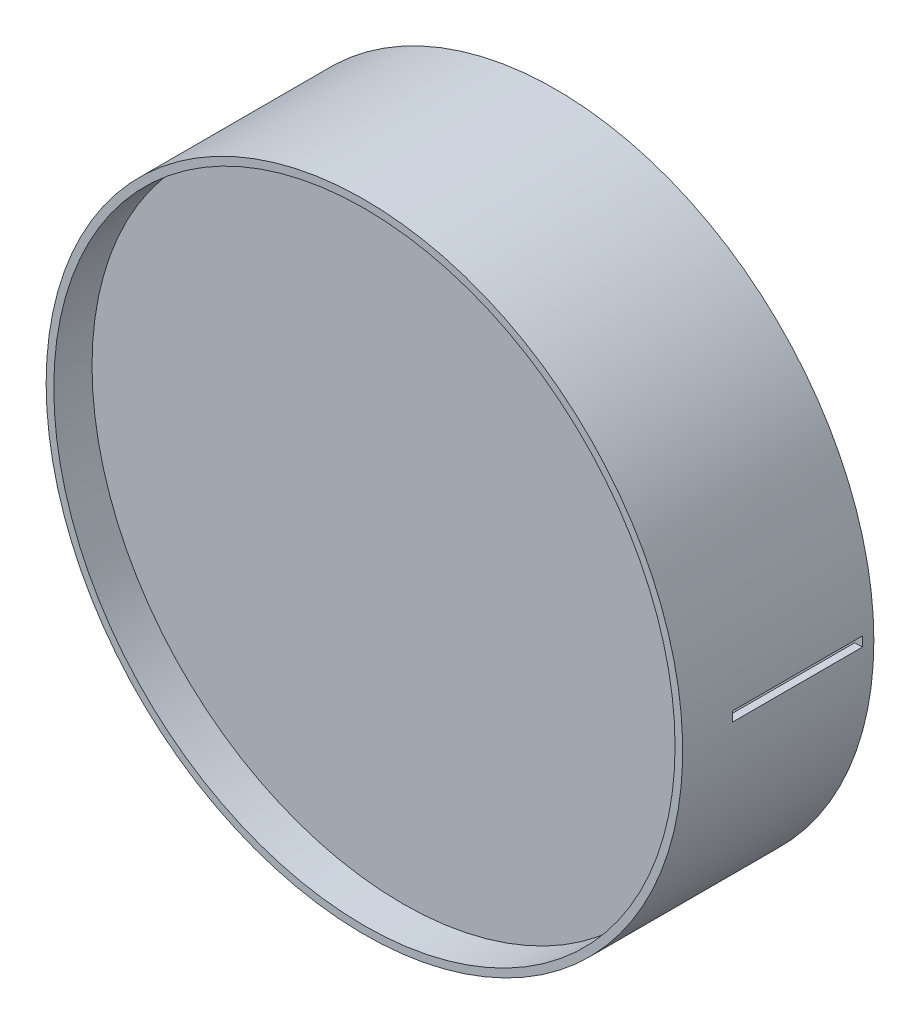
ISO-10303-21;
HEADER;
FILE_DESCRIPTION(('STEP AP214'),'2;1');
FILE_NAME('part.step','',(''),(''),'','','');
FILE_SCHEMA(('AUTOMOTIVE_DESIGN { 1 0 10303 214 1 1 1 1 }'));
ENDSEC;
DATA;
#1=APPLICATION_CONTEXT('core data for automotive mechanical design processes');
#2=APPLICATION_PROTOCOL_DEFINITION('international standard','automotive_design',2000,#1);
#3=PRODUCT_CONTEXT('',#1,'mechanical');
#4=PRODUCT('Part','Part','',(#3));
#5=PRODUCT_RELATED_PRODUCT_CATEGORY('part','',(#4));
#6=PRODUCT_DEFINITION_FORMATION('','',#4);
#7=PRODUCT_DEFINITION_CONTEXT('part definition',#1,'design');
#8=PRODUCT_DEFINITION('design','',#6,#7);
#9=PRODUCT_DEFINITION_SHAPE('','',#8);
#10=(LENGTH_UNIT() NAMED_UNIT(*) SI_UNIT(.MILLI.,.METRE.));
#11=(NAMED_UNIT(*) PLANE_ANGLE_UNIT() SI_UNIT($,.RADIAN.));
#12=(NAMED_UNIT(*) SI_UNIT($,.STERADIAN.) SOLID_ANGLE_UNIT());
#13=UNCERTAINTY_MEASURE_WITH_UNIT(LENGTH_MEASURE(1.E-05),#10,'distance_accuracy_value','');
#14=(GEOMETRIC_REPRESENTATION_CONTEXT(3) GLOBAL_UNCERTAINTY_ASSIGNED_CONTEXT((#13)) GLOBAL_UNIT_ASSIGNED_CONTEXT((#10,
#11,#12)) REPRESENTATION_CONTEXT('',''));
#15=CARTESIAN_POINT('',(0.,0.,0.));
#16=DIRECTION('',(0.,0.,1.));
#17=DIRECTION('',(1.,0.,0.));
#18=AXIS2_PLACEMENT_3D('',#15,#16,#17);
#19=CARTESIAN_POINT('',(0.,0.,18.9));
#20=DIRECTION('',(0.,0.,-1.));
#21=DIRECTION('',(1.,0.,0.));
#22=AXIS2_PLACEMENT_3D('',#19,#20,#21);
#23=CYLINDRICAL_SURFACE('',#22,32.);
#24=CARTESIAN_POINT('',(0.,0.,18.9));
#25=DIRECTION('',(0.,0.,-1.));
#26=DIRECTION('',(1.,0.,0.));
#27=AXIS2_PLACEMENT_3D('',#24,#25,#26);
#28=CIRCLE('',#27,32.);
#29=CARTESIAN_POINT('',(32.,0.,18.9));
#30=VERTEX_POINT('',#29);
#31=EDGE_CURVE('E12',#30,#30,#28,.T.);
#32=ORIENTED_EDGE('',*,*,#31,.T.);
#33=EDGE_LOOP('',(#32));
#34=FACE_BOUND('',#33,.T.);
#35=CARTESIAN_POINT('',(0.,1.01602106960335E-13,17.1));
#36=DIRECTION('',(0.,0.,-1.));
#37=DIRECTION('',(1.,0.,0.));
#38=AXIS2_PLACEMENT_3D('',#35,#36,#37);
#39=CIRCLE('',#38,32.);
#40=CARTESIAN_POINT('',(32.,1.01602106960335E-13,17.1));
#41=VERTEX_POINT('',#40);
#42=EDGE_CURVE('E66',#41,#41,#39,.T.);
#43=ORIENTED_EDGE('',*,*,#42,.F.);
#44=EDGE_LOOP('',(#43));
#45=FACE_BOUND('',#44,.T.);
#46=ADVANCED_FACE('F63',(#34,#45),#23,.T.);
#47=CARTESIAN_POINT('',(0.,0.,18.9));
#48=DIRECTION('',(0.,0.,-1.));
#49=DIRECTION('',(1.,0.,0.));
#50=AXIS2_PLACEMENT_3D('',#47,#48,#49);
#51=PLANE('',#50);
#52=ORIENTED_EDGE('',*,*,#31,.F.);
#53=EDGE_LOOP('',(#52));
#54=FACE_BOUND('',#53,.T.);
#55=ADVANCED_FACE('F78',(#54),#51,.F.);
#56=CARTESIAN_POINT('',(0.,1.01602106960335E-13,17.1));
#57=DIRECTION('',(0.,0.,-1.));
#58=DIRECTION('',(1.,0.,0.));
#59=AXIS2_PLACEMENT_3D('',#56,#57,#58);
#60=PLANE('',#59);
#61=ORIENTED_EDGE('',*,*,#42,.T.);
#62=EDGE_LOOP('',(#61));
#63=FACE_BOUND('',#62,.T.);
#64=ADVANCED_FACE('F75',(#63),#60,.T.);
#65=CLOSED_SHELL('',(#46,#55,#64));
#66=MANIFOLD_SOLID_BREP('B2_NOT_SHOWN',#65);
#67=CARTESIAN_POINT('',(0.,1.1417143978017E-13,15.3));
#68=DIRECTION('',(0.,0.,1.));
#69=DIRECTION('',(-1.,0.,0.));
#70=AXIS2_PLACEMENT_3D('',#67,#68,#69);
#71=CYLINDRICAL_SURFACE('',#70,97.5);
#72=CARTESIAN_POINT('',(0.,0.,18.9));
#73=DIRECTION('',(0.,0.,-1.));
#74=DIRECTION('',(1.,0.,0.));
#75=AXIS2_PLACEMENT_3D('',#72,#73,#74);
#76=CIRCLE('',#75,97.5);
#77=CARTESIAN_POINT('',(97.5,0.,18.9));
#78=VERTEX_POINT('',#77);
#79=CARTESIAN_POINT('',(97.4560272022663,2.92792792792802,18.9));
#80=VERTEX_POINT('',#79);
#81=EDGE_CURVE('E157',#78,#80,#76,.T.);
#82=ORIENTED_EDGE('',*,*,#81,.T.);
#83=DIRECTION('',(0.,0.,-1.));
#84=VECTOR('',#83,1.);
#85=CARTESIAN_POINT('',(97.4560272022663,2.92792792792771,63.5694964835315));
#86=LINE('',#85,#84);
#87=CARTESIAN_POINT('',(97.4560272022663,2.92792792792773,59.7));
#88=VERTEX_POINT('',#87);
#89=EDGE_CURVE('E148',#88,#80,#86,.T.);
#90=ORIENTED_EDGE('',*,*,#89,.F.);
#91=CARTESIAN_POINT('',(0.,-1.958721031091E-13,59.7));
#92=DIRECTION('',(0.,0.,1.));
#93=DIRECTION('',(-1.,0.,0.));
#94=AXIS2_PLACEMENT_3D('',#91,#92,#93);
#95=CIRCLE('',#94,97.5);
#96=CARTESIAN_POINT('',(97.5,-1.958721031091E-13,59.7));
#97=VERTEX_POINT('',#96);
#98=EDGE_CURVE('E108',#88,#97,#95,.T.);
#99=ORIENTED_EDGE('',*,*,#98,.T.);
#100=DIRECTION('',(0.,0.,-1.));
#101=VECTOR('',#100,1.);
#102=CARTESIAN_POINT('',(97.5,-2.22892652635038E-13,63.5694964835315));
#103=LINE('',#102,#101);
#104=EDGE_CURVE('E180',#97,#78,#103,.T.);
#105=ORIENTED_EDGE('',*,*,#104,.T.);
#106=EDGE_LOOP('',(#82,#90,#99,#105));
#107=FACE_BOUND('',#106,.T.);
#108=ADVANCED_FACE('F104',(#107),#71,.F.);
#109=CARTESIAN_POINT('',(0.,-1.958721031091E-13,59.7));
#110=DIRECTION('',(0.,0.,1.));
#111=DIRECTION('',(-1.,0.,0.));
#112=AXIS2_PLACEMENT_3D('',#109,#110,#111);
#113=PLANE('',#112);
#114=ORIENTED_EDGE('',*,*,#98,.F.);
#115=DIRECTION('',(-0.999548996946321,-0.03003003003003,0.));
#116=VECTOR('',#115,1.);
#117=CARTESIAN_POINT('',(0.,-1.95438617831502E-13,59.7));
#118=LINE('',#117,#116);
#119=CARTESIAN_POINT('',(99.8549447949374,2.9999999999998,59.7));
#120=VERTEX_POINT('',#119);
#121=EDGE_CURVE('E145',#120,#88,#118,.T.);
#122=ORIENTED_EDGE('',*,*,#121,.F.);
#123=CARTESIAN_POINT('',(0.,-1.958721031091E-13,59.7));
#124=DIRECTION('',(0.,0.,1.));
#125=DIRECTION('',(-1.,0.,0.));
#126=AXIS2_PLACEMENT_3D('',#123,#124,#125);
#127=CIRCLE('',#126,99.9);
#128=CARTESIAN_POINT('',(99.9,-1.958721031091E-13,59.7));
#129=VERTEX_POINT('',#128);
#130=EDGE_CURVE('E119',#129,#120,#127,.T.);
#131=ORIENTED_EDGE('',*,*,#130,.F.);
#132=DIRECTION('',(1.,0.,0.));
#133=VECTOR('',#132,1.);
#134=CARTESIAN_POINT('',(0.,-1.958721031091E-13,59.7));
#135=LINE('',#134,#133);
#136=EDGE_CURVE('E160',#97,#129,#135,.T.);
#137=ORIENTED_EDGE('',*,*,#136,.F.);
#138=EDGE_LOOP('',(#114,#122,#131,#137));
#139=FACE_BOUND('',#138,.T.);
#140=ADVANCED_FACE('F159',(#139),#113,.F.);
#141=CARTESIAN_POINT('',(0.,0.,18.9));
#142=DIRECTION('',(0.,0.,-1.));
#143=DIRECTION('',(1.,0.,0.));
#144=AXIS2_PLACEMENT_3D('',#141,#142,#143);
#145=PLANE('',#144);
#146=CARTESIAN_POINT('',(0.,0.,18.9));
#147=DIRECTION('',(0.,0.,-1.));
#148=DIRECTION('',(1.,0.,0.));
#149=AXIS2_PLACEMENT_3D('',#146,#147,#148);
#150=CIRCLE('',#149,32.);
#151=CARTESIAN_POINT('',(32.,0.,18.9));
#152=VERTEX_POINT('',#151);
#153=EDGE_CURVE('E176',#152,#152,#150,.T.);
#154=ORIENTED_EDGE('',*,*,#153,.T.);
#155=EDGE_LOOP('',(#154));
#156=FACE_BOUND('',#155,.T.);
#157=ORIENTED_EDGE('',*,*,#81,.F.);
#158=DIRECTION('',(1.,0.,0.));
#159=VECTOR('',#158,1.);
#160=CARTESIAN_POINT('',(0.,0.,18.9));
#161=LINE('',#160,#159);
#162=CARTESIAN_POINT('',(99.9,0.,18.9));
#163=VERTEX_POINT('',#162);
#164=EDGE_CURVE('E179',#78,#163,#161,.T.);
#165=ORIENTED_EDGE('',*,*,#164,.T.);
#166=CARTESIAN_POINT('',(0.,0.,18.9));
#167=DIRECTION('',(0.,0.,1.));
#168=DIRECTION('',(-1.,0.,0.));
#169=AXIS2_PLACEMENT_3D('',#166,#167,#168);
#170=CIRCLE('',#169,99.9);
#171=CARTESIAN_POINT('',(99.8549447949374,3.00000000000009,18.9));
#172=VERTEX_POINT('',#171);
#173=EDGE_CURVE('E181',#163,#172,#170,.T.);
#174=ORIENTED_EDGE('',*,*,#173,.T.);
#175=DIRECTION('',(-0.999548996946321,-0.03003003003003,0.));
#176=VECTOR('',#175,1.);
#177=CARTESIAN_POINT('',(0.,0.,18.9));
#178=LINE('',#177,#176);
#179=EDGE_CURVE('E127',#172,#80,#178,.T.);
#180=ORIENTED_EDGE('',*,*,#179,.T.);
#181=EDGE_LOOP('',(#157,#165,#174,#180));
#182=FACE_BOUND('',#181,.T.);
#183=ADVANCED_FACE('F192',(#156,#182),#145,.F.);
#184=CARTESIAN_POINT('',(0.,7.33627740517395E-13,-73.4096679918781));
#185=DIRECTION('',(0.,0.,1.));
#186=DIRECTION('',(-1.,0.,0.));
#187=AXIS2_PLACEMENT_3D('',#184,#185,#186);
#188=CYLINDRICAL_SURFACE('',#187,32.);
#189=ORIENTED_EDGE('',*,*,#153,.F.);
#190=EDGE_LOOP('',(#189));
#191=FACE_BOUND('',#190,.T.);
#192=CARTESIAN_POINT('',(0.,1.01602106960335E-13,17.1));
#193=DIRECTION('',(0.,0.,-1.));
#194=DIRECTION('',(1.,0.,0.));
#195=AXIS2_PLACEMENT_3D('',#192,#193,#194);
#196=CIRCLE('',#195,32.);
#197=CARTESIAN_POINT('',(32.,1.01602106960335E-13,17.1));
#198=VERTEX_POINT('',#197);
#199=EDGE_CURVE('E171',#198,#198,#196,.T.);
#200=ORIENTED_EDGE('',*,*,#199,.T.);
#201=EDGE_LOOP('',(#200));
#202=FACE_BOUND('',#201,.T.);
#203=ADVANCED_FACE('F237',(#191,#202),#188,.F.);
#204=CARTESIAN_POINT('',(0.,1.01602106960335E-13,17.1));
#205=DIRECTION('',(0.,0.,-1.));
#206=DIRECTION('',(1.,0.,0.));
#207=AXIS2_PLACEMENT_3D('',#204,#205,#206);
#208=PLANE('',#207);
#209=ORIENTED_EDGE('',*,*,#199,.F.);
#210=EDGE_LOOP('',(#209));
#211=FACE_BOUND('',#210,.T.);
#212=ADVANCED_FACE('F205',(#211),#208,.F.);
#213=CARTESIAN_POINT('',(0.,-2.2245916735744E-13,63.5694964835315));
#214=DIRECTION('',(0.03003003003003,-0.99954899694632,0.));
#215=DIRECTION('',(-0.999548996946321,-0.03003003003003,0.));
#216=AXIS2_PLACEMENT_3D('',#213,#214,#215);
#217=PLANE('',#216);
#218=ORIENTED_EDGE('',*,*,#121,.T.);
#219=ORIENTED_EDGE('',*,*,#89,.T.);
#220=ORIENTED_EDGE('',*,*,#179,.F.);
#221=DIRECTION('',(0.,0.,-1.));
#222=VECTOR('',#221,1.);
#223=CARTESIAN_POINT('',(99.8549447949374,2.99999999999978,63.5694964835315));
#224=LINE('',#223,#222);
#225=EDGE_CURVE('E151',#120,#172,#224,.T.);
#226=ORIENTED_EDGE('',*,*,#225,.F.);
#227=EDGE_LOOP('',(#218,#219,#220,#226));
#228=FACE_BOUND('',#227,.T.);
#229=ADVANCED_FACE('F147',(#228),#217,.T.);
#230=CARTESIAN_POINT('',(0.,-2.22892652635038E-13,63.5694964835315));
#231=DIRECTION('',(0.,1.,0.));
#232=DIRECTION('',(0.,0.,1.));
#233=AXIS2_PLACEMENT_3D('',#230,#231,#232);
#234=PLANE('',#233);
#235=ORIENTED_EDGE('',*,*,#136,.T.);
#236=DIRECTION('',(0.,0.,-1.));
#237=VECTOR('',#236,1.);
#238=CARTESIAN_POINT('',(99.9,-2.22892652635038E-13,63.5694964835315));
#239=LINE('',#238,#237);
#240=EDGE_CURVE('E184',#129,#163,#239,.T.);
#241=ORIENTED_EDGE('',*,*,#240,.T.);
#242=ORIENTED_EDGE('',*,*,#164,.F.);
#243=ORIENTED_EDGE('',*,*,#104,.F.);
#244=EDGE_LOOP('',(#235,#241,#242,#243));
#245=FACE_BOUND('',#244,.T.);
#246=ADVANCED_FACE('F196',(#245),#234,.T.);
#247=CARTESIAN_POINT('',(0.,1.1417143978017E-13,15.3));
#248=DIRECTION('',(0.,0.,1.));
#249=DIRECTION('',(-1.,0.,0.));
#250=AXIS2_PLACEMENT_3D('',#247,#248,#249);
#251=CYLINDRICAL_SURFACE('',#250,99.9);
#252=CARTESIAN_POINT('',(0.,-3.04806320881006E-13,75.3));
#253=DIRECTION('',(0.,0.,1.));
#254=DIRECTION('',(-1.,0.,0.));
#255=AXIS2_PLACEMENT_3D('',#252,#253,#254);
#256=CIRCLE('',#255,99.9);
#257=CARTESIAN_POINT('',(-99.9,-3.04806320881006E-13,75.3));
#258=VERTEX_POINT('',#257);
#259=EDGE_CURVE('E162',#258,#258,#256,.T.);
#260=ORIENTED_EDGE('',*,*,#259,.F.);
#261=EDGE_LOOP('',(#260));
#262=FACE_BOUND('',#261,.T.);
#263=CARTESIAN_POINT('',(0.,1.1417143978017E-13,15.3));
#264=DIRECTION('',(0.,0.,-1.));
#265=DIRECTION('',(1.,0.,0.));
#266=AXIS2_PLACEMENT_3D('',#263,#264,#265);
#267=CIRCLE('',#266,99.9);
#268=CARTESIAN_POINT('',(99.9,1.1417143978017E-13,15.3));
#269=VERTEX_POINT('',#268);
#270=EDGE_CURVE('E61',#269,#269,#267,.T.);
#271=ORIENTED_EDGE('',*,*,#270,.F.);
#272=EDGE_LOOP('',(#271));
#273=FACE_BOUND('',#272,.T.);
#274=ORIENTED_EDGE('',*,*,#225,.T.);
#275=ORIENTED_EDGE('',*,*,#173,.F.);
#276=ORIENTED_EDGE('',*,*,#240,.F.);
#277=ORIENTED_EDGE('',*,*,#130,.T.);
#278=EDGE_LOOP('',(#274,#275,#276,#277));
#279=FACE_BOUND('',#278,.T.);
#280=ADVANCED_FACE('F106',(#262,#273,#279),#251,.T.);
#281=CARTESIAN_POINT('',(0.,1.1417143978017E-13,15.3));
#282=DIRECTION('',(0.,0.,-1.));
#283=DIRECTION('',(1.,0.,0.));
#284=AXIS2_PLACEMENT_3D('',#281,#282,#283);
#285=PLANE('',#284);
#286=ORIENTED_EDGE('',*,*,#270,.T.);
#287=EDGE_LOOP('',(#286));
#288=FACE_BOUND('',#287,.T.);
#289=ADVANCED_FACE('F203',(#288),#285,.T.);
#290=CARTESIAN_POINT('',(0.,-3.04806320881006E-13,75.3));
#291=DIRECTION('',(0.,0.,1.));
#292=DIRECTION('',(-1.,0.,0.));
#293=AXIS2_PLACEMENT_3D('',#290,#291,#292);
#294=PLANE('',#293);
#295=ORIENTED_EDGE('',*,*,#259,.T.);
#296=EDGE_LOOP('',(#295));
#297=FACE_BOUND('',#296,.T.);
#298=CARTESIAN_POINT('',(0.,-3.04806320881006E-13,75.3));
#299=DIRECTION('',(0.,0.,1.));
#300=DIRECTION('',(-1.,0.,0.));
#301=AXIS2_PLACEMENT_3D('',#298,#299,#300);
#302=CIRCLE('',#301,97.5);
#303=CARTESIAN_POINT('',(-97.5,-3.04806320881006E-13,75.3));
#304=VERTEX_POINT('',#303);
#305=EDGE_CURVE('E165',#304,#304,#302,.T.);
#306=ORIENTED_EDGE('',*,*,#305,.F.);
#307=EDGE_LOOP('',(#306));
#308=FACE_BOUND('',#307,.T.);
#309=ADVANCED_FACE('F216',(#297,#308),#294,.T.);
#310=CARTESIAN_POINT('',(0.,-3.04806320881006E-13,75.3));
#311=DIRECTION('',(0.,0.,-1.));
#312=DIRECTION('',(1.,0.,0.));
#313=AXIS2_PLACEMENT_3D('',#310,#311,#312);
#314=CYLINDRICAL_SURFACE('',#313,97.5);
#315=ORIENTED_EDGE('',*,*,#305,.T.);
#316=EDGE_LOOP('',(#315));
#317=FACE_BOUND('',#316,.T.);
#318=CARTESIAN_POINT('',(0.,-2.2101076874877E-13,63.3));
#319=DIRECTION('',(0.,0.,1.));
#320=DIRECTION('',(-1.,0.,0.));
#321=AXIS2_PLACEMENT_3D('',#318,#319,#320);
#322=CIRCLE('',#321,97.5);
#323=CARTESIAN_POINT('',(-97.5,-2.2101076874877E-13,63.3));
#324=VERTEX_POINT('',#323);
#325=EDGE_CURVE('E168',#324,#324,#322,.T.);
#326=ORIENTED_EDGE('',*,*,#325,.F.);
#327=EDGE_LOOP('',(#326));
#328=FACE_BOUND('',#327,.T.);
#329=ADVANCED_FACE('F220',(#317,#328),#314,.F.);
#330=CARTESIAN_POINT('',(0.,-2.2101076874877E-13,63.3));
#331=DIRECTION('',(0.,0.,-1.));
#332=DIRECTION('',(1.,0.,0.));
#333=AXIS2_PLACEMENT_3D('',#330,#331,#332);
#334=PLANE('',#333);
#335=ORIENTED_EDGE('',*,*,#325,.T.);
#336=EDGE_LOOP('',(#335));
#337=FACE_BOUND('',#336,.T.);
#338=ADVANCED_FACE('F218',(#337),#334,.F.);
#339=CLOSED_SHELL('',(#108,#140,#183,#203,#212,#229,#246,#280,#289,#309,#329,#338));
#340=MANIFOLD_SOLID_BREP('B7',#339);
#341=ADVANCED_BREP_SHAPE_REPRESENTATION('',(#18,#66,#340),#14);
#342=SHAPE_DEFINITION_REPRESENTATION(#9,#341);
ENDSEC;
END-ISO-10303-21;
